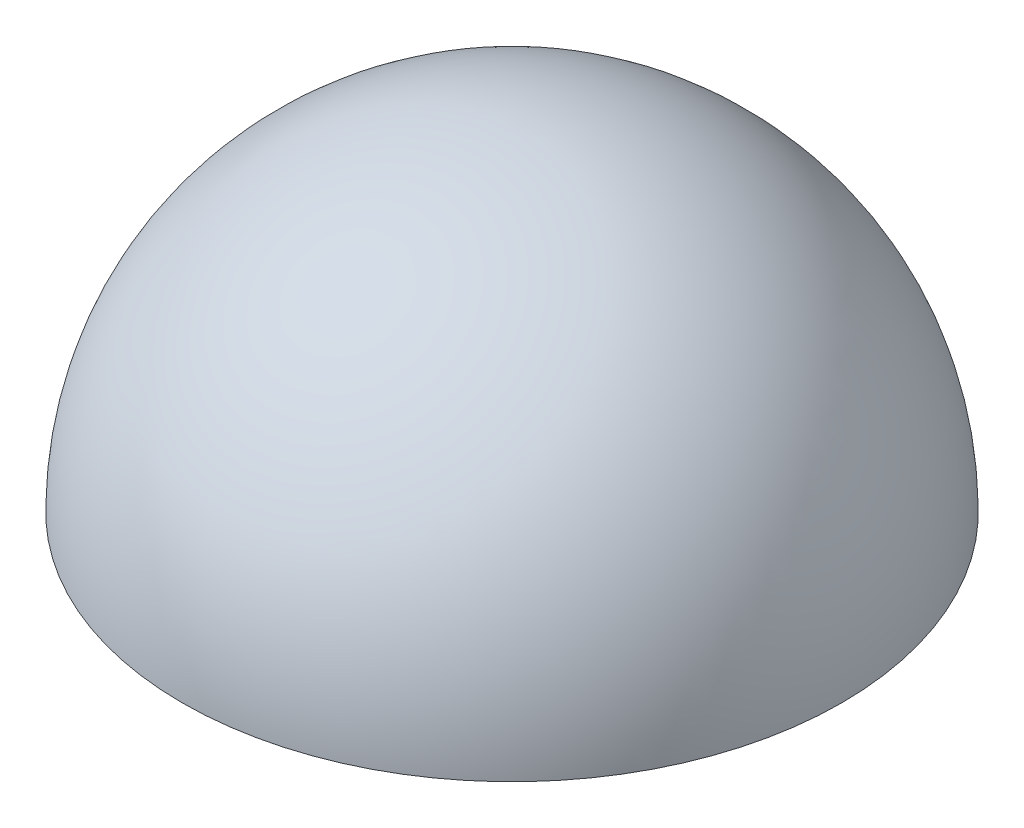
from build123d import *


with BuildPart() as part:
    # Sketch9 → Revolve1 (revolve)
    with BuildSketch(Plane.XY):
        with BuildLine():
            Line((0, 44.45), (0, 0))
            Line((0, 0), (44.45, 0))
            ThreePointArc((44.45, 0), (31.430896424, 31.430896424), (0, 44.45))
        make_face()
    revolve(axis=Axis((0, 44.45, 0), (0, -1, 0)))


solid = part.part
